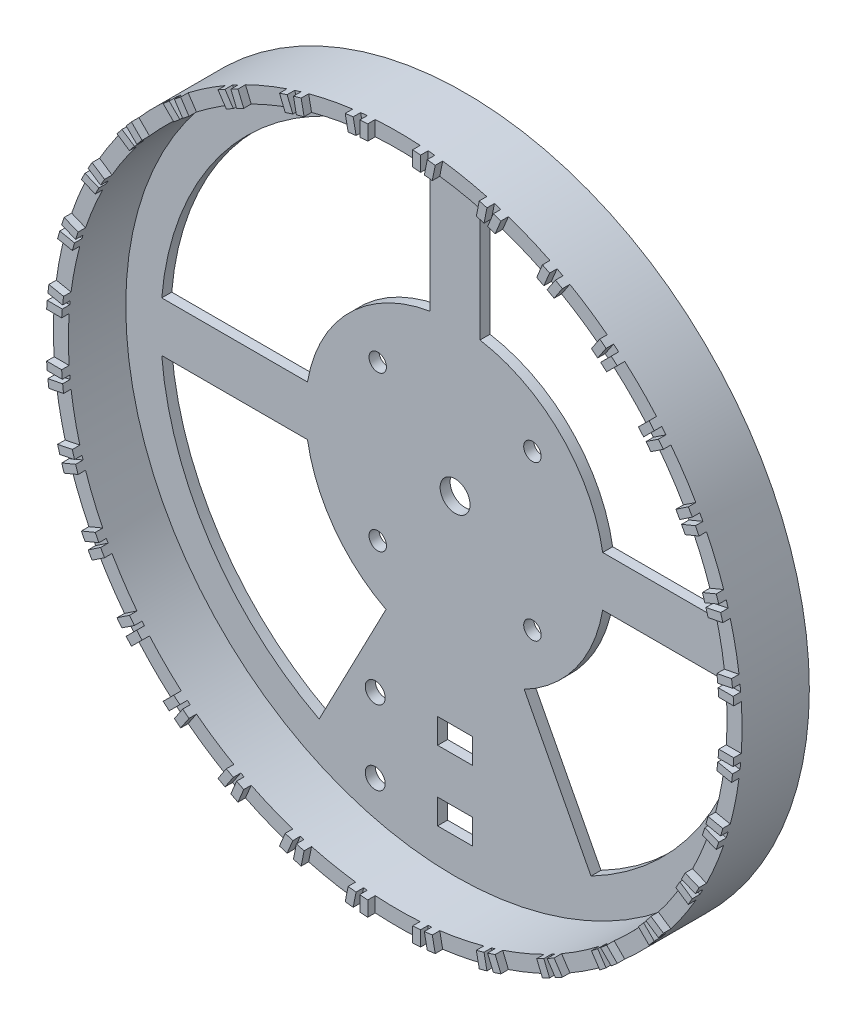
from build123d import *
from build123d.topology import SkipClean

# Parameters (mm, degrees)
ESQUISSE1_R                  = 69
BOSS_EXTRU_1_DEPTH           = 2
BOSS_EXTRU_2_START           = 11.5
ESQUISSE1_3_R                = 69
ESQUISSE1_3_R_2              = 66
BOSS_EXTRU_2_DEPTH           = 11.5
ENL_V_MAT_EXTRU_1_DEPTH      = 99.256043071
ENL_V_MAT_EXTRU_1_DEPTH_BACK = 99.256043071
ESQUISSE3_R                  = 1.75
ENL_V_MAT_EXTRU_2_DEPTH      = 99.256043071
ENL_V_MAT_EXTRU_2_DEPTH_BACK = 99.256043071
ESQUISSE1_6_W                = 7
ESQUISSE1_6_H                = 5
ESQUISSE1_6_R                = 2
BOSS_EXTRU_3_START           = 13
BOSS_EXTRU_3_DEPTH           = 1.5


with BuildPart() as part:
    # Esquisse1 → Boss.-Extru.1 (new body)
    with BuildSketch(Plane.XY):
        Circle(ESQUISSE1_R)
    extrude(amount=-BOSS_EXTRU_1_DEPTH)

    # Esquisse1_3 → Boss.-Extru.2 (add)
    with BuildSketch(Plane.XY.offset(BOSS_EXTRU_2_START)):
        Circle(ESQUISSE1_3_R)
        Circle(ESQUISSE1_3_R_2, mode=Mode.SUBTRACT)
    extrude(amount=-BOSS_EXTRU_2_DEPTH)

    # Esquisse3 → Enl_v. mat.-Extru.1 (cut, two sides: drawn at the far end of the back side and taken through both)
    with BuildSketch(Plane.XY.offset(-ENL_V_MAT_EXTRU_1_DEPTH_BACK)):
        with BuildLine():
            ThreePointArc((-13.852458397, -26.610324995), (-24.256026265, -17.65347529), (-29.580398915, -5))
            Line((-29.580398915, -5), (-58.787753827, -5))
            ThreePointArc((-58.787753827, -5), (-49.096315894, -32.719287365), (-27.243168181, -52.333639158))
            Line((-27.243168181, -52.333639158), (-13.852458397, -26.610324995))
        make_face()
        with BuildLine():
            ThreePointArc((-29.580398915, 5), (-21.213203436, 21.213203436), (-5, 29.580398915))
            Line((-5, 29.580398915), (-5, 58.787753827))
            ThreePointArc((-5, 58.787753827), (-41.71930009, 41.71930009), (-58.787753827, 5))
            Line((-58.787753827, 5), (-29.580398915, 5))
        make_face()
        with BuildLine():
            Line((0, 3), (0, 0))
            Line((0, 0), (3, 0))
            ThreePointArc((3, 0), (2.121320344, 2.121320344), (0, 3))
        make_face()
        with BuildLine():
            Line((-3, 0), (0, 0))
            Line((0, 0), (0, 3))
            ThreePointArc((0, 3), (-2.121320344, 2.121320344), (-3, 0))
        make_face()
        with BuildLine():
            Line((-1.38524584, -2.6610325), (0, 0))
            Line((0, 0), (-3, 0))
            ThreePointArc((-3, 0), (-2.564735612, -1.556319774), (-1.38524584, -2.6610325))
        make_face()
        with BuildLine():
            Line((0, -3), (0, 0))
            Line((0, 0), (-1.38524584, -2.6610325))
            ThreePointArc((-1.38524584, -2.6610325), (-0.713057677, -2.914026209), (0, -3))
        make_face()
        with BuildLine():
            Line((3, 0), (0, 0))
            Line((0, 0), (1.38524584, -2.6610325))
            ThreePointArc((1.38524584, -2.6610325), (2.564735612, -1.556319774), (3, 0))
        make_face()
        with BuildLine():
            Line((1.38524584, -2.6610325), (0, 0))
            Line((0, 0), (0, -3))
            ThreePointArc((0, -3), (0.713057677, -2.914026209), (1.38524584, -2.6610325))
        make_face()
        with BuildLine():
            Line((5, 58.787753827), (5, 29.580398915))
            ThreePointArc((5, 29.580398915), (21.213203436, 21.213203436), (29.580398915, 5))
            Line((29.580398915, 5), (58.787753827, 5))
            ThreePointArc((58.787753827, 5), (41.71930009, 41.71930009), (5, 58.787753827))
        make_face()
        with BuildLine():
            Line((58.787753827, -5), (29.580398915, -5))
            ThreePointArc((29.580398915, -5), (24.256026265, -17.65347529), (13.852458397, -26.610324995))
            Line((13.852458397, -26.610324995), (27.243168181, -52.333639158))
            ThreePointArc((27.243168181, -52.333639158), (49.096315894, -32.719287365), (58.787753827, -5))
        make_face()
        with Locations((-15.5, 15.5)):
            Circle(ESQUISSE3_R)
        with Locations((15.5, 15.5)):
            Circle(ESQUISSE3_R)
        with Locations((-15.5, -15.5)):
            Circle(ESQUISSE3_R)
        with Locations((15.5, -15.5)):
            Circle(ESQUISSE3_R)
    extrude(amount=ENL_V_MAT_EXTRU_1_DEPTH + ENL_V_MAT_EXTRU_1_DEPTH_BACK, mode=Mode.SUBTRACT)

    # Esquisse1_6 → Enl_v. mat.-Extru.2 (cut, two sides: drawn at the far end of the back side and taken through both)
    with BuildSketch(Plane.XY.offset(-ENL_V_MAT_EXTRU_2_DEPTH_BACK)):
        with Locations((0, -42.5)):
            Rectangle(ESQUISSE1_6_W, ESQUISSE1_6_H)
        with Locations((0, -56.5)):
            Rectangle(ESQUISSE1_6_W, ESQUISSE1_6_H)
        with Locations((-16, -56.95)):
            Circle(ESQUISSE1_6_R)
        with Locations((-16, -42.05)):
            Circle(ESQUISSE1_6_R)
    extrude(amount=ENL_V_MAT_EXTRU_2_DEPTH + ENL_V_MAT_EXTRU_2_DEPTH_BACK, mode=Mode.SUBTRACT)

    # Esquisse1_7 → Boss.-Extru.3 (add)
    with SkipClean():  # the faces are left unmerged after this step: merging them gives an invalid solid
        with BuildSketch(Plane.XY.offset(BOSS_EXTRU_3_START)):
            with BuildLine():
                ThreePointArc((-63.264707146, -18.803638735), (-63.488690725, -18.03291851), (-63.703285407, -17.259531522))
                Line((-63.703285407, -17.259531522), (-66.65220496, -17.846108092))
                ThreePointArc((-66.65220496, -17.846108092), (-66.44017375, -18.619970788), (-66.219157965, -19.391315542))
                Line((-66.219157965, -19.391315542), (-63.264707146, -18.803638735))
            make_face()
            with BuildLine():
                ThreePointArc((-62.556227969, -21.040873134), (-62.807469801, -20.278602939), (-63.049423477, -19.513333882))
                Line((-63.049423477, -19.513333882), (-65.832455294, -20.666103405))
                ThreePointArc((-65.832455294, -20.666103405), (-65.587687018, -21.43024292), (-65.334049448, -22.191484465))
                Line((-65.334049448, -22.191484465), (-62.556227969, -21.040873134))
            make_face()
            with BuildLine():
                ThreePointArc((-65.459098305, -8.432463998), (-65.556801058, -7.635825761), (-65.644809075, -6.838058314))
                Line((-65.644809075, -6.838058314), (-68.599259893, -7.425735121))
                ThreePointArc((-68.599259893, -7.425735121), (-68.508270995, -8.222943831), (-68.408017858, -9.019040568))
                Line((-68.408017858, -9.019040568), (-65.459098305, -8.432463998))
            make_face()
            with BuildLine():
                ThreePointArc((-65.717501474, -6.1), (-65.786821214, -5.300391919), (-65.846412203, -4.5))
                Line((-65.846412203, -4.5), (-68.853104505, -4.5))
                ThreePointArc((-68.853104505, -4.5), (-68.796120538, -5.300358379), (-68.729833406, -6.1))
                Line((-68.729833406, -6.1), (-65.717501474, -6.1))
            make_face()
            with BuildLine():
                Line((-68.853104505, 4.5), (-65.846412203, 4.5))
                ThreePointArc((-65.846412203, 4.5), (-65.786821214, 5.300391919), (-65.717501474, 6.1))
                Line((-65.717501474, 6.1), (-68.729833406, 6.1))
                ThreePointArc((-68.729833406, 6.1), (-68.796120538, 5.300358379), (-68.853104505, 4.5))
            make_face()
            with BuildLine():
                Line((-68.599259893, 7.425735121), (-65.644809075, 6.838058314))
                ThreePointArc((-65.644809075, 6.838058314), (-65.556801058, 7.635825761), (-65.459098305, 8.432463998))
                Line((-65.459098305, 8.432463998), (-68.408017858, 9.019040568))
                ThreePointArc((-68.408017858, 9.019040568), (-68.508270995, 8.222943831), (-68.599259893, 7.425735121))
            make_face()
            with BuildLine():
                Line((-66.65220496, 17.846108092), (-63.703285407, 17.259531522))
                ThreePointArc((-63.703285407, 17.259531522), (-63.488690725, 18.03291851), (-63.264707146, 18.803638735))
                Line((-63.264707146, 18.803638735), (-66.219157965, 19.391315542))
                ThreePointArc((-66.219157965, 19.391315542), (-66.44017375, 18.619970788), (-66.65220496, 17.846108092))
            make_face()
            with BuildLine():
                Line((-65.832455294, 20.666103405), (-63.049423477, 19.513333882))
                ThreePointArc((-63.049423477, 19.513333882), (-62.807469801, 20.278602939), (-62.556227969, 21.040873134))
                Line((-62.556227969, 21.040873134), (-65.334049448, 22.191484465))
                ThreePointArc((-65.334049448, 22.191484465), (-65.587687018, 21.43024292), (-65.832455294, 20.666103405))
            make_face()
            with BuildLine():
                Line((-61.889898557, 30.506400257), (-59.112077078, 29.355788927))
                ThreePointArc((-59.112077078, 29.355788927), (-58.750725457, 30.072450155), (-58.380685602, 30.784664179))
                Line((-58.380685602, 30.784664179), (-61.163717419, 31.937433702))
                ThreePointArc((-61.163717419, 31.937433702), (-61.530968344, 31.224028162), (-61.889898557, 30.506400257))
            make_face()
            with BuildLine():
                Line((-60.535746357, 33.112284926), (-58.031083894, 31.438722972))
                ThreePointArc((-58.031083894, 31.438722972), (-57.644482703, 32.142084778), (-57.249356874, 32.840693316))
                Line((-57.249356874, 32.840693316), (-59.749330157, 34.511122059))
                ThreePointArc((-59.749330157, 34.511122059), (-60.146605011, 33.813989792), (-60.535746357, 33.112284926))
            make_face()
            with BuildLine():
                Line((-54.74919806, 41.994348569), (-52.249224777, 40.323919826))
                ThreePointArc((-52.249224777, 40.323919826), (-51.755002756, 40.956314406), (-51.253127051, 41.582652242))
                Line((-51.253127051, 41.582652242), (-53.757789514, 43.256214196))
                ThreePointArc((-53.757789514, 43.256214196), (-54.257162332, 42.628163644), (-54.74919806, 41.994348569))
            make_face()
            with BuildLine():
                Line((-52.912682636, 44.285979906), (-50.7826423, 42.15593957))
                ThreePointArc((-50.7826423, 42.15593957), (-50.266250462, 42.770364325), (-49.742425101, 43.37846407))
                Line((-49.742425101, 43.37846407), (-51.868477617, 45.504516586))
                ThreePointArc((-51.868477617, 45.504516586), (-52.394122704, 44.898283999), (-52.912682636, 44.285979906))
            make_face()
            with BuildLine():
                ThreePointArc((-58.380685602, -30.784664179), (-58.750725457, -30.072450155), (-59.112077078, -29.355788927))
                Line((-59.112077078, -29.355788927), (-61.889898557, -30.506400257))
                ThreePointArc((-61.889898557, -30.506400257), (-61.530968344, -31.224028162), (-61.163717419, -31.937433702))
                Line((-61.163717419, -31.937433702), (-58.380685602, -30.784664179))
            make_face()
            with BuildLine():
                ThreePointArc((-57.249356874, -32.840693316), (-57.644482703, -32.142084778), (-58.031083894, -31.438722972))
                Line((-58.031083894, -31.438722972), (-60.535746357, -33.112284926))
                ThreePointArc((-60.535746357, -33.112284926), (-60.146605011, -33.813989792), (-59.749330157, -34.511122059))
                Line((-59.749330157, -34.511122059), (-57.249356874, -32.840693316))
            make_face()
            with BuildLine():
                ThreePointArc((-51.253127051, -41.582652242), (-51.755002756, -40.956314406), (-52.249224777, -40.323919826))
                Line((-52.249224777, -40.323919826), (-54.74919806, -41.994348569))
                ThreePointArc((-54.74919806, -41.994348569), (-54.257162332, -42.628163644), (-53.757789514, -43.256214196))
                Line((-53.757789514, -43.256214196), (-51.253127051, -41.582652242))
            make_face()
            with BuildLine():
                ThreePointArc((-49.742425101, -43.37846407), (-50.266250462, -42.770364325), (-50.7826423, -42.15593957))
                Line((-50.7826423, -42.15593957), (-52.912682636, -44.285979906))
                ThreePointArc((-52.912682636, -44.285979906), (-52.394122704, -44.898283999), (-51.868477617, -45.504516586))
                Line((-51.868477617, -45.504516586), (-49.742425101, -43.37846407))
            make_face()
            with BuildLine():
                ThreePointArc((-42.15593957, -50.7826423), (-42.770364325, -50.266250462), (-43.37846407, -49.742425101))
                Line((-43.37846407, -49.742425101), (-45.504516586, -51.868477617))
                ThreePointArc((-45.504516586, -51.868477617), (-44.898283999, -52.394122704), (-44.285979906, -52.912682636))
                Line((-44.285979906, -52.912682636), (-42.15593957, -50.7826423))
            make_face()
            with BuildLine():
                ThreePointArc((-40.323919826, -52.249224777), (-40.956314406, -51.755002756), (-41.582652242, -51.253127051))
                Line((-41.582652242, -51.253127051), (-43.256214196, -53.757789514))
                ThreePointArc((-43.256214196, -53.757789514), (-42.628163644, -54.257162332), (-41.994348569, -54.74919806))
                Line((-41.994348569, -54.74919806), (-40.323919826, -52.249224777))
            make_face()
            with BuildLine():
                ThreePointArc((-31.438722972, -58.031083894), (-32.142084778, -57.644482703), (-32.840693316, -57.249356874))
                Line((-32.840693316, -57.249356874), (-34.511122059, -59.749330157))
                ThreePointArc((-34.511122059, -59.749330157), (-33.813989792, -60.146605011), (-33.112284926, -60.535746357))
                Line((-33.112284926, -60.535746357), (-31.438722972, -58.031083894))
            make_face()
            with BuildLine():
                ThreePointArc((-29.355788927, -59.112077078), (-30.072450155, -58.750725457), (-30.784664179, -58.380685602))
                Line((-30.784664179, -58.380685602), (-31.937433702, -61.163717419))
                ThreePointArc((-31.937433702, -61.163717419), (-31.224028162, -61.530968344), (-30.506400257, -61.889898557))
                Line((-30.506400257, -61.889898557), (-29.355788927, -59.112077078))
            make_face()
            with BuildLine():
                ThreePointArc((-19.513333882, -63.049423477), (-20.278602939, -62.807469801), (-21.040873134, -62.556227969))
                Line((-21.040873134, -62.556227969), (-22.191484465, -65.334049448))
                ThreePointArc((-22.191484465, -65.334049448), (-21.43024292, -65.587687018), (-20.666103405, -65.832455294))
                Line((-20.666103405, -65.832455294), (-19.513333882, -63.049423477))
            make_face()
            with BuildLine():
                ThreePointArc((-17.259531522, -63.703285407), (-18.03291851, -63.488690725), (-18.803638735, -63.264707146))
                Line((-18.803638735, -63.264707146), (-19.391315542, -66.219157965))
                ThreePointArc((-19.391315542, -66.219157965), (-18.619970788, -66.44017375), (-17.846108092, -66.65220496))
                Line((-17.846108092, -66.65220496), (-17.259531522, -63.703285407))
            make_face()
            with BuildLine():
                ThreePointArc((-6.838058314, -65.644809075), (-7.635825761, -65.556801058), (-8.432463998, -65.459098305))
                Line((-8.432463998, -65.459098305), (-9.019040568, -68.408017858))
                ThreePointArc((-9.019040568, -68.408017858), (-8.222943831, -68.508270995), (-7.425735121, -68.599259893))
                Line((-7.425735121, -68.599259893), (-6.838058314, -65.644809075))
            make_face()
            with BuildLine():
                ThreePointArc((-4.5, -65.846412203), (-5.300391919, -65.786821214), (-6.1, -65.717501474))
                Line((-6.1, -65.717501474), (-6.1, -68.729833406))
                ThreePointArc((-6.1, -68.729833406), (-5.300358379, -68.796120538), (-4.5, -68.853104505))
                Line((-4.5, -68.853104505), (-4.5, -65.846412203))
            make_face()
            with BuildLine():
                ThreePointArc((6.1, -65.717501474), (5.300391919, -65.786821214), (4.5, -65.846412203))
                Line((4.5, -65.846412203), (4.5, -68.853104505))
                ThreePointArc((4.5, -68.853104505), (5.300358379, -68.796120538), (6.1, -68.729833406))
                Line((6.1, -68.729833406), (6.1, -65.717501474))
            make_face()
            with BuildLine():
                ThreePointArc((8.432463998, -65.459098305), (7.635825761, -65.556801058), (6.838058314, -65.644809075))
                Line((6.838058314, -65.644809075), (7.425735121, -68.599259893))
                ThreePointArc((7.425735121, -68.599259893), (8.222943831, -68.508270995), (9.019040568, -68.408017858))
                Line((9.019040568, -68.408017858), (8.432463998, -65.459098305))
            make_face()
            with BuildLine():
                ThreePointArc((18.803638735, -63.264707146), (18.03291851, -63.488690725), (17.259531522, -63.703285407))
                Line((17.259531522, -63.703285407), (17.846108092, -66.65220496))
                ThreePointArc((17.846108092, -66.65220496), (18.619970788, -66.44017375), (19.391315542, -66.219157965))
                Line((19.391315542, -66.219157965), (18.803638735, -63.264707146))
            make_face()
            with BuildLine():
                ThreePointArc((21.040873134, -62.556227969), (20.278602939, -62.807469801), (19.513333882, -63.049423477))
                Line((19.513333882, -63.049423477), (20.666103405, -65.832455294))
                ThreePointArc((20.666103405, -65.832455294), (21.43024292, -65.587687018), (22.191484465, -65.334049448))
                Line((22.191484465, -65.334049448), (21.040873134, -62.556227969))
            make_face()
            with BuildLine():
                ThreePointArc((30.784664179, -58.380685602), (30.072450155, -58.750725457), (29.355788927, -59.112077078))
                Line((29.355788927, -59.112077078), (30.506400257, -61.889898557))
                ThreePointArc((30.506400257, -61.889898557), (31.224028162, -61.530968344), (31.937433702, -61.163717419))
                Line((31.937433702, -61.163717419), (30.784664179, -58.380685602))
            make_face()
            with BuildLine():
                ThreePointArc((32.840693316, -57.249356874), (32.142084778, -57.644482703), (31.438722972, -58.031083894))
                Line((31.438722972, -58.031083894), (33.112284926, -60.535746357))
                ThreePointArc((33.112284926, -60.535746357), (33.813989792, -60.146605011), (34.511122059, -59.749330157))
                Line((34.511122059, -59.749330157), (32.840693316, -57.249356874))
            make_face()
            with BuildLine():
                ThreePointArc((41.582652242, -51.253127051), (40.956314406, -51.755002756), (40.323919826, -52.249224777))
                Line((40.323919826, -52.249224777), (41.994348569, -54.74919806))
                ThreePointArc((41.994348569, -54.74919806), (42.628163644, -54.257162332), (43.256214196, -53.757789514))
                Line((43.256214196, -53.757789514), (41.582652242, -51.253127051))
            make_face()
            with BuildLine():
                ThreePointArc((43.37846407, -49.742425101), (42.770364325, -50.266250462), (42.15593957, -50.7826423))
                Line((42.15593957, -50.7826423), (44.285979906, -52.912682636))
                ThreePointArc((44.285979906, -52.912682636), (44.898283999, -52.394122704), (45.504516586, -51.868477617))
                Line((45.504516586, -51.868477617), (43.37846407, -49.742425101))
            make_face()
            with BuildLine():
                ThreePointArc((52.249224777, -40.323919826), (51.755002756, -40.956314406), (51.253127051, -41.582652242))
                Line((51.253127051, -41.582652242), (53.757789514, -43.256214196))
                ThreePointArc((53.757789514, -43.256214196), (54.257162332, -42.628163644), (54.74919806, -41.994348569))
                Line((54.74919806, -41.994348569), (52.249224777, -40.323919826))
            make_face()
            with BuildLine():
                ThreePointArc((50.7826423, -42.15593957), (50.266250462, -42.770364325), (49.742425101, -43.37846407))
                Line((49.742425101, -43.37846407), (51.868477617, -45.504516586))
                ThreePointArc((51.868477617, -45.504516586), (52.394122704, -44.898283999), (52.912682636, -44.285979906))
                Line((52.912682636, -44.285979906), (50.7826423, -42.15593957))
            make_face()
            with BuildLine():
                ThreePointArc((58.031083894, -31.438722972), (57.644482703, -32.142084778), (57.249356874, -32.840693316))
                Line((57.249356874, -32.840693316), (59.749330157, -34.511122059))
                ThreePointArc((59.749330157, -34.511122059), (60.146605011, -33.813989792), (60.535746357, -33.112284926))
                Line((60.535746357, -33.112284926), (58.031083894, -31.438722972))
            make_face()
            with BuildLine():
                ThreePointArc((59.112077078, -29.355788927), (58.750725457, -30.072450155), (58.380685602, -30.784664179))
                Line((58.380685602, -30.784664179), (61.163717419, -31.937433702))
                ThreePointArc((61.163717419, -31.937433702), (61.530968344, -31.224028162), (61.889898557, -30.506400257))
                Line((61.889898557, -30.506400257), (59.112077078, -29.355788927))
            make_face()
            with BuildLine():
                ThreePointArc((63.049423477, -19.513333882), (62.807469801, -20.278602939), (62.556227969, -21.040873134))
                Line((62.556227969, -21.040873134), (65.334049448, -22.191484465))
                ThreePointArc((65.334049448, -22.191484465), (65.587687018, -21.43024292), (65.832455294, -20.666103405))
                Line((65.832455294, -20.666103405), (63.049423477, -19.513333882))
            make_face()
            with BuildLine():
                ThreePointArc((63.703285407, -17.259531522), (63.488690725, -18.03291851), (63.264707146, -18.803638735))
                Line((63.264707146, -18.803638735), (66.219157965, -19.391315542))
                ThreePointArc((66.219157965, -19.391315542), (66.44017375, -18.619970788), (66.65220496, -17.846108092))
                Line((66.65220496, -17.846108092), (63.703285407, -17.259531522))
            make_face()
            with BuildLine():
                ThreePointArc((65.644809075, -6.838058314), (65.556801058, -7.635825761), (65.459098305, -8.432463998))
                Line((65.459098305, -8.432463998), (68.408017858, -9.019040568))
                ThreePointArc((68.408017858, -9.019040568), (68.508270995, -8.222943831), (68.599259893, -7.425735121))
                Line((68.599259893, -7.425735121), (65.644809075, -6.838058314))
            make_face()
            with BuildLine():
                ThreePointArc((65.846412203, -4.5), (65.786821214, -5.300391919), (65.717501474, -6.1))
                Line((65.717501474, -6.1), (68.729833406, -6.1))
                ThreePointArc((68.729833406, -6.1), (68.796120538, -5.300358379), (68.853104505, -4.5))
                Line((68.853104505, -4.5), (65.846412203, -4.5))
            make_face()
            with BuildLine():
                Line((68.729833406, 6.1), (65.717501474, 6.1))
                ThreePointArc((65.717501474, 6.1), (65.786821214, 5.300391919), (65.846412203, 4.5))
                Line((65.846412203, 4.5), (68.853104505, 4.5))
                ThreePointArc((68.853104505, 4.5), (68.796120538, 5.300358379), (68.729833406, 6.1))
            make_face()
            with BuildLine():
                Line((68.408017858, 9.019040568), (65.459098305, 8.432463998))
                ThreePointArc((65.459098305, 8.432463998), (65.556801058, 7.635825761), (65.644809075, 6.838058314))
                Line((65.644809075, 6.838058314), (68.599259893, 7.425735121))
                ThreePointArc((68.599259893, 7.425735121), (68.508270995, 8.222943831), (68.408017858, 9.019040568))
            make_face()
            with BuildLine():
                Line((66.219157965, 19.391315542), (63.264707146, 18.803638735))
                ThreePointArc((63.264707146, 18.803638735), (63.488690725, 18.03291851), (63.703285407, 17.259531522))
                Line((63.703285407, 17.259531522), (66.65220496, 17.846108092))
                ThreePointArc((66.65220496, 17.846108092), (66.44017375, 18.619970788), (66.219157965, 19.391315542))
            make_face()
            with BuildLine():
                Line((65.334049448, 22.191484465), (62.556227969, 21.040873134))
                ThreePointArc((62.556227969, 21.040873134), (62.807469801, 20.278602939), (63.049423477, 19.513333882))
                Line((63.049423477, 19.513333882), (65.832455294, 20.666103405))
                ThreePointArc((65.832455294, 20.666103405), (65.587687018, 21.43024292), (65.334049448, 22.191484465))
            make_face()
            with BuildLine():
                Line((61.163717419, 31.937433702), (58.380685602, 30.784664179))
                ThreePointArc((58.380685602, 30.784664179), (58.750725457, 30.072450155), (59.112077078, 29.355788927))
                Line((59.112077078, 29.355788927), (61.889898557, 30.506400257))
                ThreePointArc((61.889898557, 30.506400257), (61.530968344, 31.224028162), (61.163717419, 31.937433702))
            make_face()
            with BuildLine():
                Line((59.749330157, 34.511122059), (57.249356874, 32.840693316))
                ThreePointArc((57.249356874, 32.840693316), (57.644482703, 32.142084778), (58.031083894, 31.438722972))
                Line((58.031083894, 31.438722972), (60.535746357, 33.112284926))
                ThreePointArc((60.535746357, 33.112284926), (60.146605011, 33.813989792), (59.749330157, 34.511122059))
            make_face()
            with BuildLine():
                Line((53.757789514, 43.256214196), (51.253127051, 41.582652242))
                ThreePointArc((51.253127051, 41.582652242), (51.755002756, 40.956314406), (52.249224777, 40.323919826))
                Line((52.249224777, 40.323919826), (54.74919806, 41.994348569))
                ThreePointArc((54.74919806, 41.994348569), (54.257162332, 42.628163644), (53.757789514, 43.256214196))
            make_face()
            with BuildLine():
                Line((51.868477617, 45.504516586), (49.742425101, 43.37846407))
                ThreePointArc((49.742425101, 43.37846407), (50.266250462, 42.770364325), (50.7826423, 42.15593957))
                Line((50.7826423, 42.15593957), (52.912682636, 44.285979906))
                ThreePointArc((52.912682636, 44.285979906), (52.394122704, 44.898283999), (51.868477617, 45.504516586))
            make_face()
            with BuildLine():
                Line((44.285979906, 52.912682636), (42.15593957, 50.7826423))
                ThreePointArc((42.15593957, 50.7826423), (42.770364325, 50.266250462), (43.37846407, 49.742425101))
                Line((43.37846407, 49.742425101), (45.504516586, 51.868477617))
                ThreePointArc((45.504516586, 51.868477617), (44.898283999, 52.394122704), (44.285979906, 52.912682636))
            make_face()
            with BuildLine():
                Line((41.994348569, 54.74919806), (40.323919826, 52.249224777))
                ThreePointArc((40.323919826, 52.249224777), (40.956314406, 51.755002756), (41.582652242, 51.253127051))
                Line((41.582652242, 51.253127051), (43.256214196, 53.757789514))
                ThreePointArc((43.256214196, 53.757789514), (42.628163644, 54.257162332), (41.994348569, 54.74919806))
            make_face()
            with BuildLine():
                Line((33.112284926, 60.535746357), (31.438722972, 58.031083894))
                ThreePointArc((31.438722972, 58.031083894), (32.142084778, 57.644482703), (32.840693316, 57.249356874))
                Line((32.840693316, 57.249356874), (34.511122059, 59.749330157))
                ThreePointArc((34.511122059, 59.749330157), (33.813989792, 60.146605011), (33.112284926, 60.535746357))
            make_face()
            with BuildLine():
                Line((30.506400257, 61.889898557), (29.355788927, 59.112077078))
                ThreePointArc((29.355788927, 59.112077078), (30.072450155, 58.750725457), (30.784664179, 58.380685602))
                Line((30.784664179, 58.380685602), (31.937433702, 61.163717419))
                ThreePointArc((31.937433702, 61.163717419), (31.224028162, 61.530968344), (30.506400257, 61.889898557))
            make_face()
            with BuildLine():
                Line((20.666103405, 65.832455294), (19.513333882, 63.049423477))
                ThreePointArc((19.513333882, 63.049423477), (20.278602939, 62.807469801), (21.040873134, 62.556227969))
                Line((21.040873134, 62.556227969), (22.191484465, 65.334049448))
                ThreePointArc((22.191484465, 65.334049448), (21.43024292, 65.587687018), (20.666103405, 65.832455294))
            make_face()
            with BuildLine():
                Line((17.846108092, 66.65220496), (17.259531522, 63.703285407))
                ThreePointArc((17.259531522, 63.703285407), (18.03291851, 63.488690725), (18.803638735, 63.264707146))
                Line((18.803638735, 63.264707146), (19.391315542, 66.219157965))
                ThreePointArc((19.391315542, 66.219157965), (18.619970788, 66.44017375), (17.846108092, 66.65220496))
            make_face()
            with BuildLine():
                Line((7.425735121, 68.599259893), (6.838058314, 65.644809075))
                ThreePointArc((6.838058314, 65.644809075), (7.635825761, 65.556801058), (8.432463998, 65.459098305))
                Line((8.432463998, 65.459098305), (9.019040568, 68.408017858))
                ThreePointArc((9.019040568, 68.408017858), (8.222943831, 68.508270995), (7.425735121, 68.599259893))
            make_face()
            with BuildLine():
                Line((4.5, 68.853104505), (4.5, 65.846412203))
                ThreePointArc((4.5, 65.846412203), (5.300391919, 65.786821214), (6.1, 65.717501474))
                Line((6.1, 65.717501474), (6.1, 68.729833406))
                ThreePointArc((6.1, 68.729833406), (5.300358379, 68.796120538), (4.5, 68.853104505))
            make_face()
            with BuildLine():
                Line((-6.1, 68.729833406), (-6.1, 65.717501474))
                ThreePointArc((-6.1, 65.717501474), (-5.300391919, 65.786821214), (-4.5, 65.846412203))
                Line((-4.5, 65.846412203), (-4.5, 68.853104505))
                ThreePointArc((-4.5, 68.853104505), (-5.300358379, 68.796120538), (-6.1, 68.729833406))
            make_face()
            with BuildLine():
                Line((-9.019040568, 68.408017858), (-8.432463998, 65.459098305))
                ThreePointArc((-8.432463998, 65.459098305), (-7.635825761, 65.556801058), (-6.838058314, 65.644809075))
                Line((-6.838058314, 65.644809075), (-7.425735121, 68.599259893))
                ThreePointArc((-7.425735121, 68.599259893), (-8.222943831, 68.508270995), (-9.019040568, 68.408017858))
            make_face()
            with BuildLine():
                Line((-19.391315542, 66.219157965), (-18.803638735, 63.264707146))
                ThreePointArc((-18.803638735, 63.264707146), (-18.03291851, 63.488690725), (-17.259531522, 63.703285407))
                Line((-17.259531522, 63.703285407), (-17.846108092, 66.65220496))
                ThreePointArc((-17.846108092, 66.65220496), (-18.619970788, 66.44017375), (-19.391315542, 66.219157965))
            make_face()
            with BuildLine():
                Line((-22.191484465, 65.334049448), (-21.040873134, 62.556227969))
                ThreePointArc((-21.040873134, 62.556227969), (-20.278602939, 62.807469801), (-19.513333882, 63.049423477))
                Line((-19.513333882, 63.049423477), (-20.666103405, 65.832455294))
                ThreePointArc((-20.666103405, 65.832455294), (-21.43024292, 65.587687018), (-22.191484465, 65.334049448))
            make_face()
            with BuildLine():
                Line((-45.504516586, 51.868477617), (-43.37846407, 49.742425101))
                ThreePointArc((-43.37846407, 49.742425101), (-42.770364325, 50.266250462), (-42.15593957, 50.7826423))
                Line((-42.15593957, 50.7826423), (-44.285979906, 52.912682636))
                ThreePointArc((-44.285979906, 52.912682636), (-44.898283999, 52.394122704), (-45.504516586, 51.868477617))
            make_face()
            with BuildLine():
                Line((-43.256214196, 53.757789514), (-41.582652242, 51.253127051))
                ThreePointArc((-41.582652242, 51.253127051), (-40.956314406, 51.755002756), (-40.323919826, 52.249224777))
                Line((-40.323919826, 52.249224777), (-41.994348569, 54.74919806))
                ThreePointArc((-41.994348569, 54.74919806), (-42.628163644, 54.257162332), (-43.256214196, 53.757789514))
            make_face()
            with BuildLine():
                Line((-34.511122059, 59.749330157), (-32.840693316, 57.249356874))
                ThreePointArc((-32.840693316, 57.249356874), (-32.142084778, 57.644482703), (-31.438722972, 58.031083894))
                Line((-31.438722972, 58.031083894), (-33.112284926, 60.535746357))
                ThreePointArc((-33.112284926, 60.535746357), (-33.813989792, 60.146605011), (-34.511122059, 59.749330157))
            make_face()
            with BuildLine():
                Line((-31.937433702, 61.163717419), (-30.784664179, 58.380685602))
                ThreePointArc((-30.784664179, 58.380685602), (-30.072450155, 58.750725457), (-29.355788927, 59.112077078))
                Line((-29.355788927, 59.112077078), (-30.506400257, 61.889898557))
                ThreePointArc((-30.506400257, 61.889898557), (-31.224028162, 61.530968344), (-31.937433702, 61.163717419))
            make_face()
        extrude(amount=-BOSS_EXTRU_3_DEPTH)


solid = part.part
